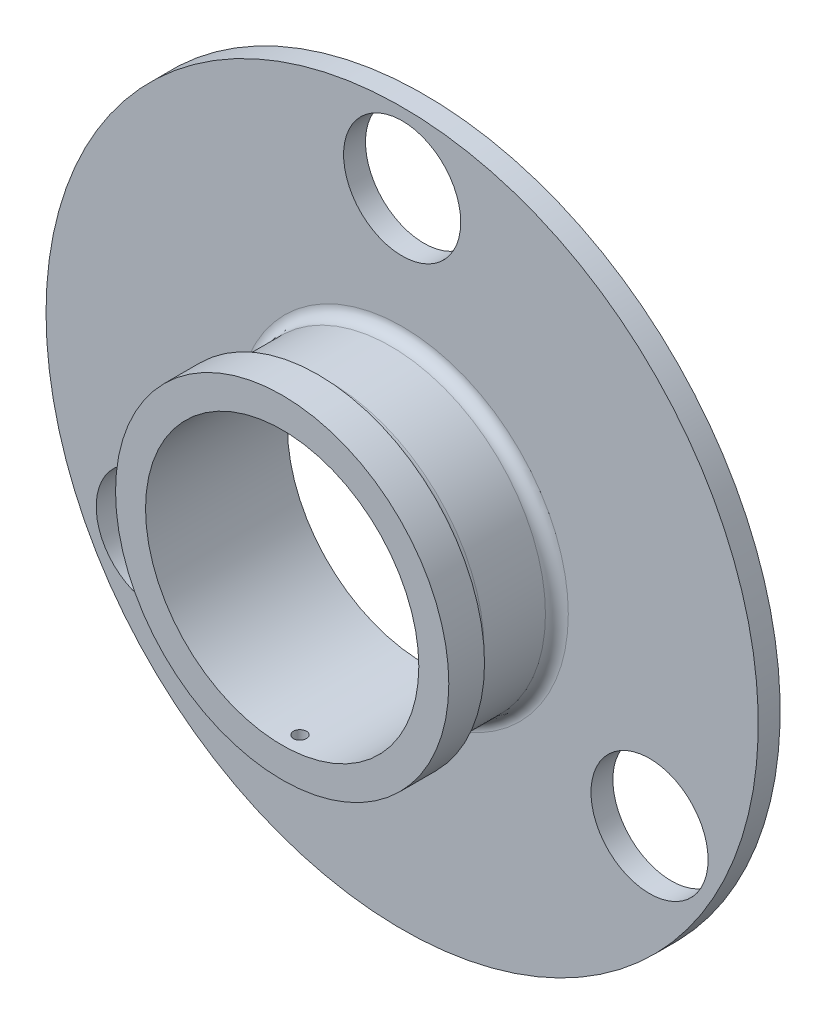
from build123d import *

# Parameters (mm, degrees)
CUT_EXTRUDE1_REACH         = 140.104
SKETCH2_R                  = 15.621
CIRPATTERN1_COUNT          = 3
F_8_32_TAPPED_HOLE1_REACH  = 173.942
F_8_32_TAPPED_HOLE1_BORE_R = 1.7272


with BuildPart() as part:
    # Sketch1 → Revolve1 (revolve)
    with BuildSketch(Plane(origin=(0, 0, 0), x_dir=(1, 0, 0), z_dir=(0, 1, 0)), mode=Mode.PRIVATE) as revolve1_sk:
        with BuildLine():
            Line((36.449, 0), (94.996, 0))
            Line((94.996, 0), (94.996, -5.842))
            Line((94.996, -5.842), (44.323, -5.842))
            ThreePointArc((44.323, -5.842), (42.167738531, -6.734738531), (41.275, -8.89))
            Line((41.275, -8.89), (41.275, -25.273))
            ThreePointArc((41.275, -25.273), (42.167738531, -27.428261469), (44.323, -28.321))
            Line((44.323, -28.321), (44.45, -28.321))
            Line((44.45, -28.321), (44.45, -37.846))
            Line((44.45, -37.846), (36.449, -37.846))
            Line((36.449, -37.846), (36.449, 0))
        make_face()
    revolve(revolve1_sk.sketch.rotate(Axis((0, 0, 0), (0, 0, 1)), 180), axis=Axis((0, 0, 0), (0, 0, 1)))

    # Sketch2 → Cut-Extrude1 (cut, up to next)
    with BuildSketch(Plane.XY.offset(5.842), mode=Mode.PRIVATE) as cut_extrude1_sk1:
        with Locations((0, 76.2)):
            Circle(SKETCH2_R)
    cut_extrude1_tool1 = extrude(cut_extrude1_sk1.sketch, amount=-CUT_EXTRUDE1_REACH, mode=Mode.PRIVATE) & part.part
    cut_extrude1 = cut_extrude1_tool1.solids().sort_by_distance((0, 76.2, 5.842))[0]
    add(cut_extrude1, mode=Mode.SUBTRACT)

    # CirPattern1: Cut-Extrude1 ×3 about axis
    cirpattern1_axis = Axis((0, 0, 0), (0, 0, 1))
    for i in range(1, CIRPATTERN1_COUNT):
        add(cut_extrude1.rotate(cirpattern1_axis, i * 360 / CIRPATTERN1_COUNT), mode=Mode.SUBTRACT)

    # 8-32 Tapped Hole1 bore (on position points) → 8-32 Tapped Hole1 (cut, up to next)
    with BuildSketch(Plane(origin=(0, -44.45, 33.0835), x_dir=(-1, 0, 0), z_dir=(0, -1, 0)), mode=Mode.PRIVATE) as f_8_32_tapped_hole1_sk1:
        Circle(F_8_32_TAPPED_HOLE1_BORE_R)
    f_8_32_tapped_hole1_tool1 = extrude(f_8_32_tapped_hole1_sk1.sketch, amount=-F_8_32_TAPPED_HOLE1_REACH, mode=Mode.PRIVATE) & part.part
    add(f_8_32_tapped_hole1_tool1.solids().sort_by_distance((0, -44.45, 33.0835))[0], mode=Mode.SUBTRACT)


solid = part.part
